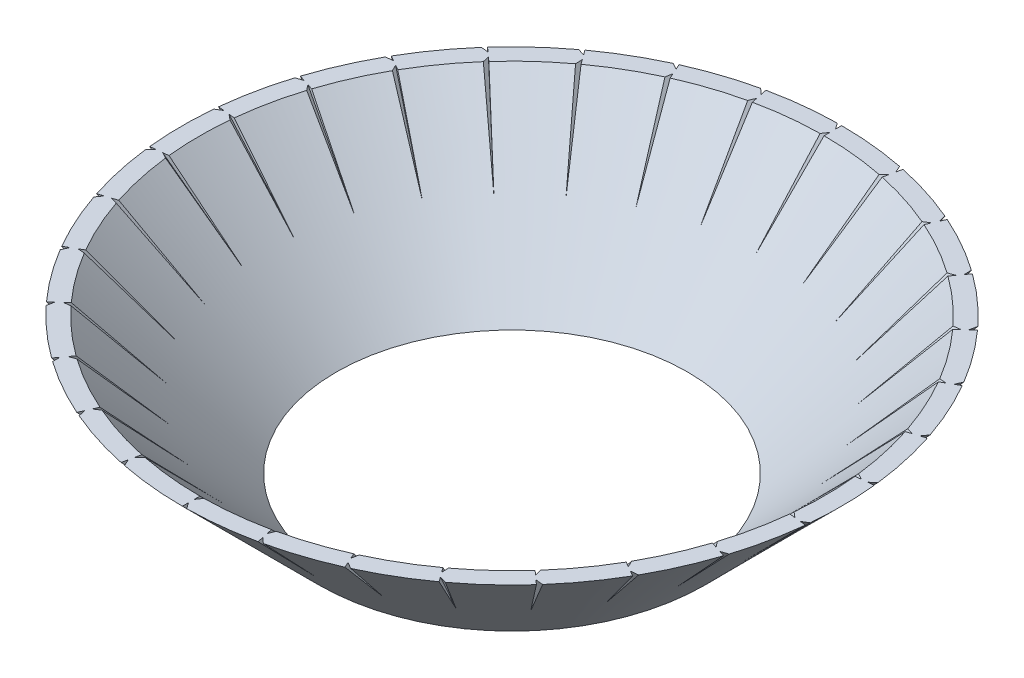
from build123d import *

# Parameters (mm, degrees)
CIRPATTERN1_COUNT = 30


with BuildPart() as part:
    # Sketch1 → Base-Revolve (revolve)
    with BuildSketch(Plane(origin=(0, 0, 0), x_dir=(0, 0, -1), z_dir=(1, 0, 0))):
        Polygon((8.5, 0), (15.1, 6.6), (15.948528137, 6.6), (9.348528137, 0), align=None)
    revolve(axis=Axis((0, -30, 0), (0, 1, 0)))

    # Cut-Sweep1: sweep along a path in Sketch3
    with BuildLine(Plane(origin=(0, 0, 0), x_dir=(0, 0, -1), z_dir=(1, 0, 0))) as cut_sweep1_path:
        Line((11.8, 3.3), (16.464867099, 7.6))
    # Sketch5 → Cut-Sweep1 (sweep, cut)
    with BuildSketch(Plane(origin=(0, 3.3, -11.8), x_dir=(-1, 0, 0), z_dir=(0, 0.6777666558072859, -0.7352770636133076))):
        Polygon((0, 0), (0, 1), (1, 1), align=None)
    cut_sweep1 = sweep(path=cut_sweep1_path.line, mode=Mode.SUBTRACT)

    # Mirror2: Cut-Sweep1 across plane
    add(cut_sweep1.mirror(Plane(origin=(0, -4.462132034, -4.462132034), x_dir=(0, -0.7071067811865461, 0.707106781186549), z_dir=(0, -0.7071067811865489, -0.7071067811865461))), mode=Mode.SUBTRACT)

    # CirPattern1: Cut-Sweep1 ×30 about axis
    cirpattern1_axis = Axis((0, 0, 0), (0, 1, 0))
    for i in range(1, CIRPATTERN1_COUNT):
        add(cut_sweep1.rotate(cirpattern1_axis, i * 360 / CIRPATTERN1_COUNT), mode=Mode.SUBTRACT)

    # CirPattern1 copy 1: sweep along a path in CirPattern1 copy 1 path
    with BuildLine(Plane(origin=(-1.855458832, -8.924264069, -8.729247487), x_dir=(0, 1, 0), z_dir=(0.9781476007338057, 0, -0.20791169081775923))) as cirpattern1_copy_1_path:
        Line((11.8, -3.3), (16.464867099, -7.6))
    # CirPattern1 copy 1 sketch → CirPattern1 copy 1 (sweep, cut)
    with BuildSketch(Plane(origin=(-2.541567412, 2.875735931, -11.95713457), x_dir=(-0.9781476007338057, 0, 0.20791169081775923), z_dir=(-0.14091561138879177, 0.7352770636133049, -0.6629558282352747))):
        Polygon((0, 0), (0, -1), (1, -1), align=None)
    sweep(path=cirpattern1_copy_1_path.line, mode=Mode.SUBTRACT)

    # CirPattern1 copy 2: sweep along a path in CirPattern1 copy 2 path
    with BuildLine(Plane(origin=(-3.629825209, -8.924264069, -8.152720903), x_dir=(0, 1, 0), z_dir=(0.9135454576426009, 0, -0.4067366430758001))) as cirpattern1_copy_2_path:
        Line((11.8, -3.3), (16.464867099, -7.6))
    # CirPattern1 copy 2 sketch → CirPattern1 copy 2 (sweep, cut)
    with BuildSketch(Plane(origin=(-4.972056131, 2.875735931, -11.167420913), x_dir=(-0.9135454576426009, 0, 0.4067366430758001), z_dir=(-0.275672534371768, 0.7352770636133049, -0.6191706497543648))):
        Polygon((0, 0), (0, -1), (1, -1), align=None)
    sweep(path=cirpattern1_copy_2_path.line, mode=Mode.SUBTRACT)

    # CirPattern1 copy 3: sweep along a path in CirPattern1 copy 3 path
    with BuildLine(Plane(origin=(-5.245550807, -8.924264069, -7.219881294), x_dir=(0, 1, 0), z_dir=(0.8090169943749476, 0, -0.587785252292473))) as cirpattern1_copy_3_path:
        Line((11.8, -3.3), (16.464867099, -7.6))
    # CirPattern1 copy 3 sketch → CirPattern1 copy 3 (sweep, cut)
    with BuildSketch(Plane(origin=(-7.18524214, 2.875735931, -9.889637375), x_dir=(-0.8090169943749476, 0, 0.587785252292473), z_dir=(-0.3983812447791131, 0.7352770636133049, -0.5483247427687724))):
        Polygon((0, 0), (0, -1), (1, -1), align=None)
    sweep(path=cirpattern1_copy_3_path.line, mode=Mode.SUBTRACT)

    # CirPattern1 copy 4: sweep along a path in CirPattern1 copy 4 path
    with BuildLine(Plane(origin=(-6.632020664, -8.924264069, -5.971498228), x_dir=(0, 1, 0), z_dir=(0.6691306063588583, 0, -0.7431448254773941))) as cirpattern1_copy_4_path:
        Line((11.8, -3.3), (16.464867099, -7.6))
    # CirPattern1 copy 4 sketch → CirPattern1 copy 4 (sweep, cut)
    with BuildSketch(Plane(origin=(-9.084398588, 2.875735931, -8.179629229), x_dir=(-0.6691306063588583, 0, 0.7431448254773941), z_dir=(-0.5036787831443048, 0.7352770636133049, -0.45351441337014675))):
        Polygon((0, 0), (0, -1), (1, -1), align=None)
    sweep(path=cirpattern1_copy_4_path.line, mode=Mode.SUBTRACT)

    # CirPattern1 copy 5: sweep along a path in CirPattern1 copy 5 path
    with BuildLine(Plane(origin=(-7.728639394, -8.924264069, -4.462132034), x_dir=(0, 1, 0), z_dir=(0.5000000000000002, 0, -0.8660254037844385))) as cirpattern1_copy_5_path:
        Line((11.8, -3.3), (16.464867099, -7.6))
    # CirPattern1 copy 5 sketch → CirPattern1 copy 5 (sweep, cut)
    with BuildSketch(Plane(origin=(-10.586523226, 2.875735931, -6.112132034), x_dir=(-0.5000000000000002, 0, 0.8660254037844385), z_dir=(-0.5869631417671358, 0.7352770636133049, -0.3388833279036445))):
        Polygon((0, 0), (0, -1), (1, -1), align=None)
    sweep(path=cirpattern1_copy_5_path.line, mode=Mode.SUBTRACT)

    # CirPattern1 copy 6: sweep along a path in CirPattern1 copy 6 path
    with BuildLine(Plane(origin=(-8.487479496, -8.924264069, -2.75774926), x_dir=(0, 1, 0), z_dir=(0.30901699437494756, 0, -0.9510565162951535))) as cirpattern1_copy_6_path:
        Line((11.8, -3.3), (16.464867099, -7.6))
    # CirPattern1 copy 6 sketch → CirPattern1 copy 6 (sweep, cut)
    with BuildSketch(Plane(origin=(-11.625965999, 2.875735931, -3.777505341), x_dir=(-0.30901699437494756, 0, 0.9510565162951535), z_dir=(-0.6445943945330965, 0.7352770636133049, -0.20944141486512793))):
        Polygon((0, 0), (0, -1), (1, -1), align=None)
    sweep(path=cirpattern1_copy_6_path.line, mode=Mode.SUBTRACT)

    # CirPattern1 copy 7: sweep along a path in CirPattern1 copy 7 path
    with BuildLine(Plane(origin=(-8.875376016, -8.924264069, -0.932839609), x_dir=(0, 1, 0), z_dir=(0.10452846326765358, 0, -0.9945218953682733))) as cirpattern1_copy_7_path:
        Line((11.8, -3.3), (16.464867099, -7.6))
    # CirPattern1 copy 7 sketch → CirPattern1 copy 7 (sweep, cut)
    with BuildSketch(Plane(origin=(-12.157298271, 2.875735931, -1.277783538), x_dir=(-0.10452846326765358, 0, 0.9945218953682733), z_dir=(-0.6740537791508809, 0.7352770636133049, -0.07084590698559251))):
        Polygon((0, 0), (0, -1), (1, -1), align=None)
    sweep(path=cirpattern1_copy_7_path.line, mode=Mode.SUBTRACT)

    # CirPattern1 copy 8: sweep along a path in CirPattern1 copy 8 path
    with BuildLine(Plane(origin=(-8.875376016, -8.924264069, 0.932839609), x_dir=(0, 1, 0), z_dir=(-0.10452846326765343, 0, -0.9945218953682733))) as cirpattern1_copy_8_path:
        Line((11.8, -3.3), (16.464867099, -7.6))
    # CirPattern1 copy 8 sketch → CirPattern1 copy 8 (sweep, cut)
    with BuildSketch(Plane(origin=(-12.157298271, 2.875735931, 1.277783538), x_dir=(0.10452846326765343, 0, 0.9945218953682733), z_dir=(-0.6740537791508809, 0.7352770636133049, 0.0708459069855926))):
        Polygon((0, 0), (0, -1), (1, -1), align=None)
    sweep(path=cirpattern1_copy_8_path.line, mode=Mode.SUBTRACT)

    # CirPattern1 copy 9: sweep along a path in CirPattern1 copy 9 path
    with BuildLine(Plane(origin=(-8.487479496, -8.924264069, 2.75774926), x_dir=(0, 1, 0), z_dir=(-0.30901699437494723, 0, -0.9510565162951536))) as cirpattern1_copy_9_path:
        Line((11.8, -3.3), (16.464867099, -7.6))
    # CirPattern1 copy 9 sketch → CirPattern1 copy 9 (sweep, cut)
    with BuildSketch(Plane(origin=(-11.625965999, 2.875735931, 3.777505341), x_dir=(0.30901699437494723, 0, 0.9510565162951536), z_dir=(-0.6445943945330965, 0.7352770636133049, 0.20944141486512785))):
        Polygon((0, 0), (0, -1), (1, -1), align=None)
    sweep(path=cirpattern1_copy_9_path.line, mode=Mode.SUBTRACT)

    # CirPattern1 copy 10: sweep along a path in CirPattern1 copy 10 path
    with BuildLine(Plane(origin=(-7.728639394, -8.924264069, 4.462132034), x_dir=(0, 1, 0), z_dir=(-0.49999999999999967, 0, -0.8660254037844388))) as cirpattern1_copy_10_path:
        Line((11.8, -3.3), (16.464867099, -7.6))
    # CirPattern1 copy 10 sketch → CirPattern1 copy 10 (sweep, cut)
    with BuildSketch(Plane(origin=(-10.586523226, 2.875735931, 6.112132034), x_dir=(0.49999999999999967, 0, 0.8660254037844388), z_dir=(-0.586963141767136, 0.7352770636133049, 0.3388833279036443))):
        Polygon((0, 0), (0, -1), (1, -1), align=None)
    sweep(path=cirpattern1_copy_10_path.line, mode=Mode.SUBTRACT)

    # CirPattern1 copy 11: sweep along a path in CirPattern1 copy 11 path
    with BuildLine(Plane(origin=(-6.632020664, -8.924264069, 5.971498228), x_dir=(0, 1, 0), z_dir=(-0.6691306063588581, 0, -0.7431448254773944))) as cirpattern1_copy_11_path:
        Line((11.8, -3.3), (16.464867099, -7.6))
    # CirPattern1 copy 11 sketch → CirPattern1 copy 11 (sweep, cut)
    with BuildSketch(Plane(origin=(-9.084398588, 2.875735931, 8.179629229), x_dir=(0.6691306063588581, 0, 0.7431448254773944), z_dir=(-0.5036787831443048, 0.7352770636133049, 0.45351441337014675))):
        Polygon((0, 0), (0, -1), (1, -1), align=None)
    sweep(path=cirpattern1_copy_11_path.line, mode=Mode.SUBTRACT)

    # CirPattern1 copy 12: sweep along a path in CirPattern1 copy 12 path
    with BuildLine(Plane(origin=(-5.245550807, -8.924264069, 7.219881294), x_dir=(0, 1, 0), z_dir=(-0.8090169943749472, 0, -0.5877852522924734))) as cirpattern1_copy_12_path:
        Line((11.8, -3.3), (16.464867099, -7.6))
    # CirPattern1 copy 12 sketch → CirPattern1 copy 12 (sweep, cut)
    with BuildSketch(Plane(origin=(-7.18524214, 2.875735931, 9.889637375), x_dir=(0.8090169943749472, 0, 0.5877852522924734), z_dir=(-0.3983812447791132, 0.7352770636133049, 0.5483247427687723))):
        Polygon((0, 0), (0, -1), (1, -1), align=None)
    sweep(path=cirpattern1_copy_12_path.line, mode=Mode.SUBTRACT)

    # CirPattern1 copy 13: sweep along a path in CirPattern1 copy 13 path
    with BuildLine(Plane(origin=(-3.629825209, -8.924264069, 8.152720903), x_dir=(0, 1, 0), z_dir=(-0.9135454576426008, 0, -0.40673664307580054))) as cirpattern1_copy_13_path:
        Line((11.8, -3.3), (16.464867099, -7.6))
    # CirPattern1 copy 13 sketch → CirPattern1 copy 13 (sweep, cut)
    with BuildSketch(Plane(origin=(-4.972056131, 2.875735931, 11.167420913), x_dir=(0.9135454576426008, 0, 0.40673664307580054), z_dir=(-0.2756725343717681, 0.7352770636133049, 0.6191706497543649))):
        Polygon((0, 0), (0, -1), (1, -1), align=None)
    sweep(path=cirpattern1_copy_13_path.line, mode=Mode.SUBTRACT)

    # CirPattern1 copy 14: sweep along a path in CirPattern1 copy 14 path
    with BuildLine(Plane(origin=(-1.855458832, -8.924264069, 8.729247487), x_dir=(0, 1, 0), z_dir=(-0.9781476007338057, 0, -0.20791169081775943))) as cirpattern1_copy_14_path:
        Line((11.8, -3.3), (16.464867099, -7.6))
    # CirPattern1 copy 14 sketch → CirPattern1 copy 14 (sweep, cut)
    with BuildSketch(Plane(origin=(-2.541567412, 2.875735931, 11.95713457), x_dir=(0.9781476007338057, 0, 0.20791169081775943), z_dir=(-0.14091561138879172, 0.7352770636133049, 0.6629558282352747))):
        Polygon((0, 0), (0, -1), (1, -1), align=None)
    sweep(path=cirpattern1_copy_14_path.line, mode=Mode.SUBTRACT)

    # CirPattern1 copy 15: sweep along a path in CirPattern1 copy 15 path
    with BuildLine(Plane(origin=(0, -8.924264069, 8.924264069), x_dir=(0, 1, 0), z_dir=(-1, 0, 0))) as cirpattern1_copy_15_path:
        Line((11.8, -3.3), (16.464867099, -7.6))
    # CirPattern1 copy 15 sketch → CirPattern1 copy 15 (sweep, cut)
    with BuildSketch(Plane(origin=(0, 2.875735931, 12.224264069), x_dir=(1, 0, 0), z_dir=(0, 0.7352770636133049, 0.6777666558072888))):
        Polygon((0, 0), (0, -1), (1, -1), align=None)
    sweep(path=cirpattern1_copy_15_path.line, mode=Mode.SUBTRACT)

    # CirPattern1 copy 16: sweep along a path in CirPattern1 copy 16 path
    with BuildLine(Plane(origin=(1.855458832, -8.924264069, 8.729247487), x_dir=(0, 1, 0), z_dir=(-0.9781476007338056, 0, 0.2079116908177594))) as cirpattern1_copy_16_path:
        Line((11.8, -3.3), (16.464867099, -7.6))
    # CirPattern1 copy 16 sketch → CirPattern1 copy 16 (sweep, cut)
    with BuildSketch(Plane(origin=(2.541567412, 2.875735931, 11.95713457), x_dir=(0.9781476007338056, 0, -0.2079116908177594), z_dir=(0.14091561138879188, 0.7352770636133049, 0.6629558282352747))):
        Polygon((0, 0), (0, -1), (1, -1), align=None)
    sweep(path=cirpattern1_copy_16_path.line, mode=Mode.SUBTRACT)

    # CirPattern1 copy 17: sweep along a path in CirPattern1 copy 17 path
    with BuildLine(Plane(origin=(3.629825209, -8.924264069, 8.152720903), x_dir=(0, 1, 0), z_dir=(-0.9135454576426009, 0, 0.4067366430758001))) as cirpattern1_copy_17_path:
        Line((11.8, -3.3), (16.464867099, -7.6))
    # CirPattern1 copy 17 sketch → CirPattern1 copy 17 (sweep, cut)
    with BuildSketch(Plane(origin=(4.972056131, 2.875735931, 11.167420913), x_dir=(0.9135454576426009, 0, -0.4067366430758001), z_dir=(0.275672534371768, 0.7352770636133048, 0.6191706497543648))):
        Polygon((0, 0), (0, -1), (1, -1), align=None)
    sweep(path=cirpattern1_copy_17_path.line, mode=Mode.SUBTRACT)

    # CirPattern1 copy 18: sweep along a path in CirPattern1 copy 18 path
    with BuildLine(Plane(origin=(5.245550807, -8.924264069, 7.219881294), x_dir=(0, 1, 0), z_dir=(-0.8090169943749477, 0, 0.5877852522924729))) as cirpattern1_copy_18_path:
        Line((11.8, -3.3), (16.464867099, -7.6))
    # CirPattern1 copy 18 sketch → CirPattern1 copy 18 (sweep, cut)
    with BuildSketch(Plane(origin=(7.18524214, 2.875735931, 9.889637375), x_dir=(0.8090169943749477, 0, -0.5877852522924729), z_dir=(0.39838124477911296, 0.7352770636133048, 0.5483247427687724))):
        Polygon((0, 0), (0, -1), (1, -1), align=None)
    sweep(path=cirpattern1_copy_18_path.line, mode=Mode.SUBTRACT)

    # CirPattern1 copy 19: sweep along a path in CirPattern1 copy 19 path
    with BuildLine(Plane(origin=(6.632020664, -8.924264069, 5.971498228), x_dir=(0, 1, 0), z_dir=(-0.6691306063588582, 0, 0.7431448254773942))) as cirpattern1_copy_19_path:
        Line((11.8, -3.3), (16.464867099, -7.6))
    # CirPattern1 copy 19 sketch → CirPattern1 copy 19 (sweep, cut)
    with BuildSketch(Plane(origin=(9.084398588, 2.875735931, 8.179629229), x_dir=(0.6691306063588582, 0, -0.7431448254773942), z_dir=(0.5036787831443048, 0.7352770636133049, 0.4535144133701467))):
        Polygon((0, 0), (0, -1), (1, -1), align=None)
    sweep(path=cirpattern1_copy_19_path.line, mode=Mode.SUBTRACT)

    # CirPattern1 copy 20: sweep along a path in CirPattern1 copy 20 path
    with BuildLine(Plane(origin=(7.728639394, -8.924264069, 4.462132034), x_dir=(0, 1, 0), z_dir=(-0.5000000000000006, 0, 0.8660254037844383))) as cirpattern1_copy_20_path:
        Line((11.8, -3.3), (16.464867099, -7.6))
    # CirPattern1 copy 20 sketch → CirPattern1 copy 20 (sweep, cut)
    with BuildSketch(Plane(origin=(10.586523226, 2.875735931, 6.112132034), x_dir=(0.5000000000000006, 0, -0.8660254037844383), z_dir=(0.5869631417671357, 0.7352770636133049, 0.3388833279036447))):
        Polygon((0, 0), (0, -1), (1, -1), align=None)
    sweep(path=cirpattern1_copy_20_path.line, mode=Mode.SUBTRACT)

    # CirPattern1 copy 21: sweep along a path in CirPattern1 copy 21 path
    with BuildLine(Plane(origin=(8.487479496, -8.924264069, 2.75774926), x_dir=(0, 1, 0), z_dir=(-0.3090169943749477, 0, 0.9510565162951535))) as cirpattern1_copy_21_path:
        Line((11.8, -3.3), (16.464867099, -7.6))
    # CirPattern1 copy 21 sketch → CirPattern1 copy 21 (sweep, cut)
    with BuildSketch(Plane(origin=(11.625965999, 2.875735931, 3.777505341), x_dir=(0.3090169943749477, 0, -0.9510565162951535), z_dir=(0.6445943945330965, 0.7352770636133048, 0.209441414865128))):
        Polygon((0, 0), (0, -1), (1, -1), align=None)
    sweep(path=cirpattern1_copy_21_path.line, mode=Mode.SUBTRACT)

    # CirPattern1 copy 22: sweep along a path in CirPattern1 copy 22 path
    with BuildLine(Plane(origin=(8.875376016, -8.924264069, 0.932839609), x_dir=(0, 1, 0), z_dir=(-0.10452846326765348, 0, 0.9945218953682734))) as cirpattern1_copy_22_path:
        Line((11.8, -3.3), (16.464867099, -7.6))
    # CirPattern1 copy 22 sketch → CirPattern1 copy 22 (sweep, cut)
    with BuildSketch(Plane(origin=(12.157298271, 2.875735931, 1.277783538), x_dir=(0.10452846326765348, 0, -0.9945218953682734), z_dir=(0.674053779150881, 0.7352770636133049, 0.07084590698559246))):
        Polygon((0, 0), (0, -1), (1, -1), align=None)
    sweep(path=cirpattern1_copy_22_path.line, mode=Mode.SUBTRACT)

    # CirPattern1 copy 23: sweep along a path in CirPattern1 copy 23 path
    with BuildLine(Plane(origin=(8.875376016, -8.924264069, -0.932839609), x_dir=(0, 1, 0), z_dir=(0.10452846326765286, 0, 0.9945218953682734))) as cirpattern1_copy_23_path:
        Line((11.8, -3.3), (16.464867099, -7.6))
    # CirPattern1 copy 23 sketch → CirPattern1 copy 23 (sweep, cut)
    with BuildSketch(Plane(origin=(12.157298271, 2.875735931, -1.277783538), x_dir=(-0.10452846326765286, 0, -0.9945218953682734), z_dir=(0.674053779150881, 0.7352770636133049, -0.0708459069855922))):
        Polygon((0, 0), (0, -1), (1, -1), align=None)
    sweep(path=cirpattern1_copy_23_path.line, mode=Mode.SUBTRACT)

    # CirPattern1 copy 24: sweep along a path in CirPattern1 copy 24 path
    with BuildLine(Plane(origin=(8.487479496, -8.924264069, -2.75774926), x_dir=(0, 1, 0), z_dir=(0.3090169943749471, 0, 0.9510565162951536))) as cirpattern1_copy_24_path:
        Line((11.8, -3.3), (16.464867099, -7.6))
    # CirPattern1 copy 24 sketch → CirPattern1 copy 24 (sweep, cut)
    with BuildSketch(Plane(origin=(11.625965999, 2.875735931, -3.777505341), x_dir=(-0.3090169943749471, 0, -0.9510565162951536), z_dir=(0.6445943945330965, 0.7352770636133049, -0.2094414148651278))):
        Polygon((0, 0), (0, -1), (1, -1), align=None)
    sweep(path=cirpattern1_copy_24_path.line, mode=Mode.SUBTRACT)

    # CirPattern1 copy 25: sweep along a path in CirPattern1 copy 25 path
    with BuildLine(Plane(origin=(7.728639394, -8.924264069, -4.462132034), x_dir=(0, 1, 0), z_dir=(0.5, 0, 0.8660254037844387))) as cirpattern1_copy_25_path:
        Line((11.8, -3.3), (16.464867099, -7.6))
    # CirPattern1 copy 25 sketch → CirPattern1 copy 25 (sweep, cut)
    with BuildSketch(Plane(origin=(10.586523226, 2.875735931, -6.112132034), x_dir=(-0.5, 0, -0.8660254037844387), z_dir=(0.586963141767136, 0.7352770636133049, -0.3388833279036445))):
        Polygon((0, 0), (0, -1), (1, -1), align=None)
    sweep(path=cirpattern1_copy_25_path.line, mode=Mode.SUBTRACT)

    # CirPattern1 copy 26: sweep along a path in CirPattern1 copy 26 path
    with BuildLine(Plane(origin=(6.632020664, -8.924264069, -5.971498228), x_dir=(0, 1, 0), z_dir=(0.6691306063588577, 0, 0.7431448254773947))) as cirpattern1_copy_26_path:
        Line((11.8, -3.3), (16.464867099, -7.6))
    # CirPattern1 copy 26 sketch → CirPattern1 copy 26 (sweep, cut)
    with BuildSketch(Plane(origin=(9.084398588, 2.875735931, -8.179629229), x_dir=(-0.6691306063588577, 0, -0.7431448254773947), z_dir=(0.503678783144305, 0.7352770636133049, -0.4535144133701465))):
        Polygon((0, 0), (0, -1), (1, -1), align=None)
    sweep(path=cirpattern1_copy_26_path.line, mode=Mode.SUBTRACT)

    # CirPattern1 copy 27: sweep along a path in CirPattern1 copy 27 path
    with BuildLine(Plane(origin=(5.245550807, -8.924264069, -7.219881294), x_dir=(0, 1, 0), z_dir=(0.8090169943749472, 0, 0.5877852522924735))) as cirpattern1_copy_27_path:
        Line((11.8, -3.3), (16.464867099, -7.6))
    # CirPattern1 copy 27 sketch → CirPattern1 copy 27 (sweep, cut)
    with BuildSketch(Plane(origin=(7.18524214, 2.875735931, -9.889637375), x_dir=(-0.8090169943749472, 0, -0.5877852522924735), z_dir=(0.39838124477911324, 0.7352770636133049, -0.5483247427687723))):
        Polygon((0, 0), (0, -1), (1, -1), align=None)
    sweep(path=cirpattern1_copy_27_path.line, mode=Mode.SUBTRACT)

    # CirPattern1 copy 28: sweep along a path in CirPattern1 copy 28 path
    with BuildLine(Plane(origin=(3.629825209, -8.924264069, -8.152720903), x_dir=(0, 1, 0), z_dir=(0.913545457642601, 0, 0.40673664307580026))) as cirpattern1_copy_28_path:
        Line((11.8, -3.3), (16.464867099, -7.6))
    # CirPattern1 copy 28 sketch → CirPattern1 copy 28 (sweep, cut)
    with BuildSketch(Plane(origin=(4.972056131, 2.875735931, -11.167420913), x_dir=(-0.913545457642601, 0, -0.40673664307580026), z_dir=(0.2756725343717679, 0.7352770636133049, -0.619170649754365))):
        Polygon((0, 0), (0, -1), (1, -1), align=None)
    sweep(path=cirpattern1_copy_28_path.line, mode=Mode.SUBTRACT)

    # CirPattern1 copy 29: sweep along a path in CirPattern1 copy 29 path
    with BuildLine(Plane(origin=(1.855458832, -8.924264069, -8.729247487), x_dir=(0, 1, 0), z_dir=(0.9781476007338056, 0, 0.20791169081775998))) as cirpattern1_copy_29_path:
        Line((11.8, -3.3), (16.464867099, -7.6))
    # CirPattern1 copy 29 sketch → CirPattern1 copy 29 (sweep, cut)
    with BuildSketch(Plane(origin=(2.541567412, 2.875735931, -11.95713457), x_dir=(-0.9781476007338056, 0, -0.20791169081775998), z_dir=(0.1409156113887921, 0.7352770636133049, -0.6629558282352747))):
        Polygon((0, 0), (0, -1), (1, -1), align=None)
    sweep(path=cirpattern1_copy_29_path.line, mode=Mode.SUBTRACT)


solid = part.part
